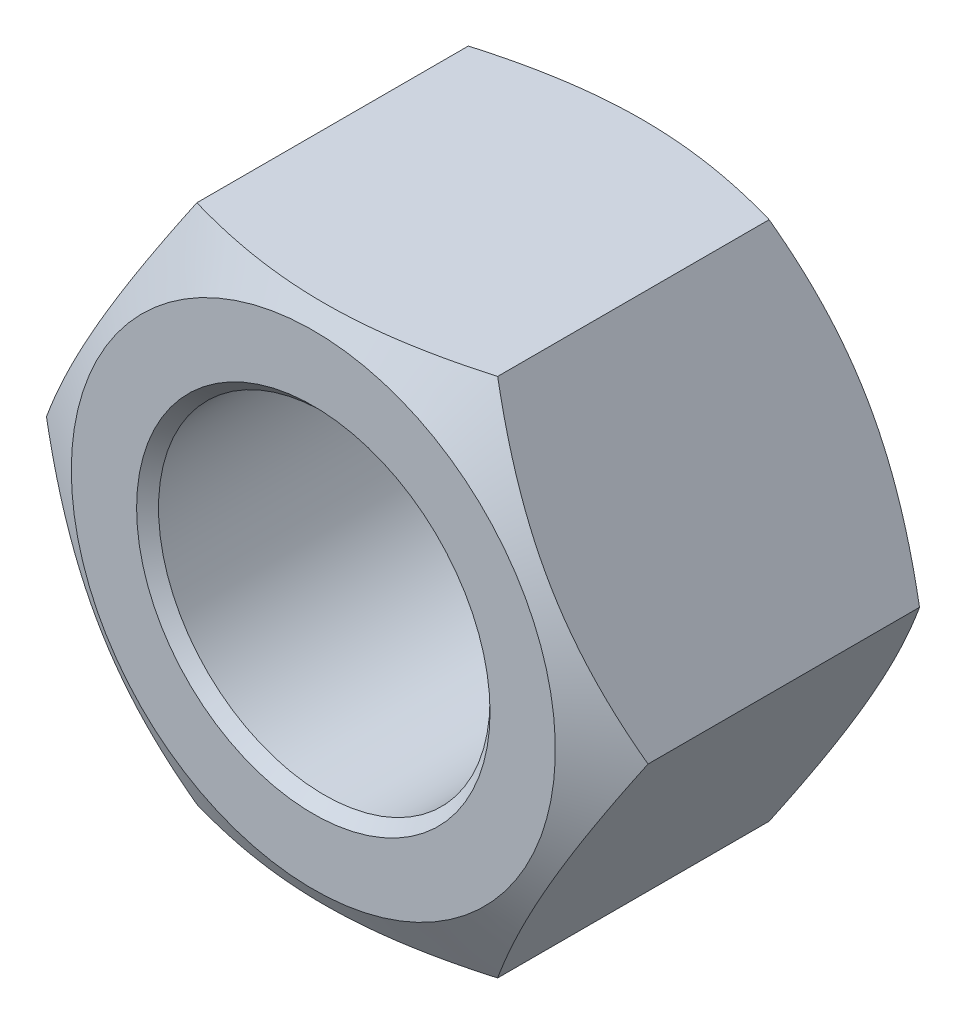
from build123d import *

# Parameters (mm, degrees)
SKETCH1_R        = 17.5
BASENUT_DEPTH    = 34.7
ENDCHAMFER2_SIZE = 1.156666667


with BuildPart() as part:
    # Sketch1 → BaseNut (new body)
    with BuildSketch(Plane.XY):
        Polygon((15.877132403, -27.5), (31.754264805, 0), (15.877132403, 27.5), (-15.877132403, 27.5), (-31.754264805, 0), (-15.877132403, -27.5), align=None)
        Circle(SKETCH1_R, mode=Mode.SUBTRACT)
    extrude(amount=-BASENUT_DEPTH)

    # Sketch2 → Chamfer1 (revolve, cut)
    with BuildSketch(Plane(origin=(15.04811501, 0, -16.706149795), x_dir=(0, 0, -1), z_dir=(0, 1, 0))):
        Polygon((15.537649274, 46.802379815), (17.993850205, 42.54811501), (17.993850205, 46.802379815), align=None)
    revolve(axis=Axis((0, 0, 7.016501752), (0, 0, -1)), mode=Mode.SUBTRACT)

    # Sketch6 → EndChamfer1 (revolve, cut)
    with BuildSketch(Plane(origin=(-9.197458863, 0, -10.252541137), x_dir=(0, 0, 1), z_dir=(0, 1, 0))):
        Polygon((-24.447458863, 26.697458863), (-24.447458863, 28.647458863), (-23.321625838, 26.697458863), align=None)
    revolve(axis=Axis((0, 0, 13.104863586), (0, 0, -1)), mode=Mode.SUBTRACT)

    # Sketch5 → Chamfer2 (revolve, cut)
    with BuildSketch(Plane(origin=(-14.793032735, 0, -16.96123207), x_dir=(0, 0, 1), z_dir=(0, 1, 0)), mode=Mode.PRIVATE) as chamfer2_sk:
        Polygon((16.96123207, 40.343032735), (16.96123207, 46.547297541), (13.379198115, 46.547297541), align=None)
    revolve(chamfer2_sk.sketch.rotate(Axis((0, 0, -39.536013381), (0, 0, 1)), 180), axis=Axis((0, 0, -39.536013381), (0, 0, 1)), mode=Mode.SUBTRACT)

    # EndChamfer2
    endchamfer2_edges = [part.edges().sort_by_distance(p)[0] for p in [
        (-17.5, 0, 0),
    ]]
    chamfer(endchamfer2_edges, length=ENDCHAMFER2_SIZE)


solid = part.part
